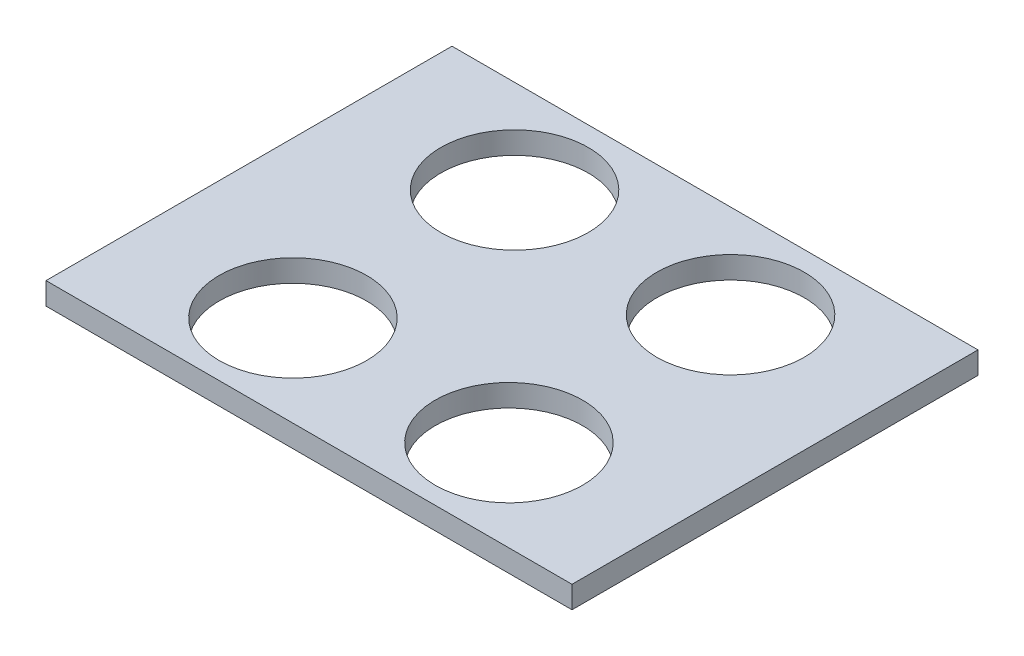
ISO-10303-21;
HEADER;
FILE_DESCRIPTION(('STEP AP214'),'2;1');
FILE_NAME('part.step','',(''),(''),'','','');
FILE_SCHEMA(('AUTOMOTIVE_DESIGN { 1 0 10303 214 1 1 1 1 }'));
ENDSEC;
DATA;
#1=APPLICATION_CONTEXT('core data for automotive mechanical design processes');
#2=APPLICATION_PROTOCOL_DEFINITION('international standard','automotive_design',2000,#1);
#3=PRODUCT_CONTEXT('',#1,'mechanical');
#4=PRODUCT('Part','Part','',(#3));
#5=PRODUCT_RELATED_PRODUCT_CATEGORY('part','',(#4));
#6=PRODUCT_DEFINITION_FORMATION('','',#4);
#7=PRODUCT_DEFINITION_CONTEXT('part definition',#1,'design');
#8=PRODUCT_DEFINITION('design','',#6,#7);
#9=PRODUCT_DEFINITION_SHAPE('','',#8);
#10=(LENGTH_UNIT() NAMED_UNIT(*) SI_UNIT(.MILLI.,.METRE.));
#11=(NAMED_UNIT(*) PLANE_ANGLE_UNIT() SI_UNIT($,.RADIAN.));
#12=(NAMED_UNIT(*) SI_UNIT($,.STERADIAN.) SOLID_ANGLE_UNIT());
#13=UNCERTAINTY_MEASURE_WITH_UNIT(LENGTH_MEASURE(1.E-05),#10,'distance_accuracy_value','');
#14=(GEOMETRIC_REPRESENTATION_CONTEXT(3) GLOBAL_UNCERTAINTY_ASSIGNED_CONTEXT((#13)) GLOBAL_UNIT_ASSIGNED_CONTEXT((#10,
#11,#12)) REPRESENTATION_CONTEXT('',''));
#15=CARTESIAN_POINT('',(0.,0.,0.));
#16=DIRECTION('',(0.,0.,1.));
#17=DIRECTION('',(1.,0.,0.));
#18=AXIS2_PLACEMENT_3D('',#15,#16,#17);
#19=CARTESIAN_POINT('',(-32.3739168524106,3.,28.235904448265));
#20=DIRECTION('',(1.,0.,0.));
#21=DIRECTION('',(0.,0.,-1.));
#22=AXIS2_PLACEMENT_3D('',#19,#20,#21);
#23=PLANE('',#22);
#24=DIRECTION('',(0.,0.,1.));
#25=VECTOR('',#24,1.);
#26=CARTESIAN_POINT('',(-32.3739168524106,0.,28.235904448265));
#27=LINE('',#26,#25);
#28=CARTESIAN_POINT('',(-32.3739168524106,0.,-26.8170664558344));
#29=VERTEX_POINT('',#28);
#30=CARTESIAN_POINT('',(-32.3739168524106,0.,28.235904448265));
#31=VERTEX_POINT('',#30);
#32=EDGE_CURVE('E98',#29,#31,#27,.T.);
#33=ORIENTED_EDGE('',*,*,#32,.T.);
#34=DIRECTION('',(0.,-1.,0.));
#35=VECTOR('',#34,1.);
#36=CARTESIAN_POINT('',(-32.3739168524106,3.,28.235904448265));
#37=LINE('',#36,#35);
#38=CARTESIAN_POINT('',(-32.3739168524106,3.,28.235904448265));
#39=VERTEX_POINT('',#38);
#40=EDGE_CURVE('E11',#39,#31,#37,.T.);
#41=ORIENTED_EDGE('',*,*,#40,.F.);
#42=DIRECTION('',(0.,0.,1.));
#43=VECTOR('',#42,1.);
#44=CARTESIAN_POINT('',(-32.3739168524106,3.,28.235904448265));
#45=LINE('',#44,#43);
#46=CARTESIAN_POINT('',(-32.3739168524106,3.,-26.8170664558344));
#47=VERTEX_POINT('',#46);
#48=EDGE_CURVE('E86',#47,#39,#45,.T.);
#49=ORIENTED_EDGE('',*,*,#48,.F.);
#50=DIRECTION('',(0.,-1.,0.));
#51=VECTOR('',#50,1.);
#52=CARTESIAN_POINT('',(-32.3739168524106,3.,-26.8170664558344));
#53=LINE('',#52,#51);
#54=EDGE_CURVE('E94',#47,#29,#53,.T.);
#55=ORIENTED_EDGE('',*,*,#54,.T.);
#56=EDGE_LOOP('',(#33,#41,#49,#55));
#57=FACE_BOUND('',#56,.T.);
#58=ADVANCED_FACE('F35',(#57),#23,.F.);
#59=CARTESIAN_POINT('',(38.9525737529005,3.,28.235904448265));
#60=DIRECTION('',(0.,0.,-1.));
#61=DIRECTION('',(-1.,0.,0.));
#62=AXIS2_PLACEMENT_3D('',#59,#60,#61);
#63=PLANE('',#62);
#64=DIRECTION('',(1.,0.,0.));
#65=VECTOR('',#64,1.);
#66=CARTESIAN_POINT('',(38.9525737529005,0.,28.235904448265));
#67=LINE('',#66,#65);
#68=CARTESIAN_POINT('',(38.9525737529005,0.,28.235904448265));
#69=VERTEX_POINT('',#68);
#70=EDGE_CURVE('E90',#31,#69,#67,.T.);
#71=ORIENTED_EDGE('',*,*,#70,.T.);
#72=DIRECTION('',(0.,-1.,0.));
#73=VECTOR('',#72,1.);
#74=CARTESIAN_POINT('',(38.9525737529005,3.,28.235904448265));
#75=LINE('',#74,#73);
#76=CARTESIAN_POINT('',(38.9525737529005,3.,28.235904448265));
#77=VERTEX_POINT('',#76);
#78=EDGE_CURVE('E43',#77,#69,#75,.T.);
#79=ORIENTED_EDGE('',*,*,#78,.F.);
#80=DIRECTION('',(1.,0.,0.));
#81=VECTOR('',#80,1.);
#82=CARTESIAN_POINT('',(38.9525737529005,3.,28.235904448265));
#83=LINE('',#82,#81);
#84=EDGE_CURVE('E81',#39,#77,#83,.T.);
#85=ORIENTED_EDGE('',*,*,#84,.F.);
#86=ORIENTED_EDGE('',*,*,#40,.T.);
#87=EDGE_LOOP('',(#71,#79,#85,#86));
#88=FACE_BOUND('',#87,.T.);
#89=ADVANCED_FACE('F89',(#88),#63,.F.);
#90=CARTESIAN_POINT('',(38.9525737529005,3.,-26.8170664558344));
#91=DIRECTION('',(-1.,0.,0.));
#92=DIRECTION('',(0.,0.,1.));
#93=AXIS2_PLACEMENT_3D('',#90,#91,#92);
#94=PLANE('',#93);
#95=DIRECTION('',(0.,0.,-1.));
#96=VECTOR('',#95,1.);
#97=CARTESIAN_POINT('',(38.9525737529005,0.,-26.8170664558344));
#98=LINE('',#97,#96);
#99=CARTESIAN_POINT('',(38.9525737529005,0.,-26.8170664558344));
#100=VERTEX_POINT('',#99);
#101=EDGE_CURVE('E68',#69,#100,#98,.T.);
#102=ORIENTED_EDGE('',*,*,#101,.T.);
#103=DIRECTION('',(0.,-1.,0.));
#104=VECTOR('',#103,1.);
#105=CARTESIAN_POINT('',(38.9525737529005,3.,-26.8170664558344));
#106=LINE('',#105,#104);
#107=CARTESIAN_POINT('',(38.9525737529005,3.,-26.8170664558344));
#108=VERTEX_POINT('',#107);
#109=EDGE_CURVE('E91',#108,#100,#106,.T.);
#110=ORIENTED_EDGE('',*,*,#109,.F.);
#111=DIRECTION('',(0.,0.,-1.));
#112=VECTOR('',#111,1.);
#113=CARTESIAN_POINT('',(38.9525737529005,3.,-26.8170664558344));
#114=LINE('',#113,#112);
#115=EDGE_CURVE('E84',#77,#108,#114,.T.);
#116=ORIENTED_EDGE('',*,*,#115,.F.);
#117=ORIENTED_EDGE('',*,*,#78,.T.);
#118=EDGE_LOOP('',(#102,#110,#116,#117));
#119=FACE_BOUND('',#118,.T.);
#120=ADVANCED_FACE('F92',(#119),#94,.F.);
#121=CARTESIAN_POINT('',(-32.3739168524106,3.,-26.8170664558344));
#122=DIRECTION('',(0.,0.,1.));
#123=DIRECTION('',(1.,0.,0.));
#124=AXIS2_PLACEMENT_3D('',#121,#122,#123);
#125=PLANE('',#124);
#126=DIRECTION('',(-1.,0.,0.));
#127=VECTOR('',#126,1.);
#128=CARTESIAN_POINT('',(-32.3739168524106,0.,-26.8170664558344));
#129=LINE('',#128,#127);
#130=EDGE_CURVE('E74',#100,#29,#129,.T.);
#131=ORIENTED_EDGE('',*,*,#130,.T.);
#132=ORIENTED_EDGE('',*,*,#54,.F.);
#133=DIRECTION('',(-1.,0.,0.));
#134=VECTOR('',#133,1.);
#135=CARTESIAN_POINT('',(-32.3739168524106,3.,-26.8170664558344));
#136=LINE('',#135,#134);
#137=EDGE_CURVE('E51',#108,#47,#136,.T.);
#138=ORIENTED_EDGE('',*,*,#137,.F.);
#139=ORIENTED_EDGE('',*,*,#109,.T.);
#140=EDGE_LOOP('',(#131,#132,#138,#139));
#141=FACE_BOUND('',#140,.T.);
#142=ADVANCED_FACE('F106',(#141),#125,.F.);
#143=CARTESIAN_POINT('',(0.,3.,0.));
#144=DIRECTION('',(0.,-1.,0.));
#145=DIRECTION('',(0.,0.,-1.));
#146=AXIS2_PLACEMENT_3D('',#143,#144,#145);
#147=PLANE('',#146);
#148=CARTESIAN_POINT('',(-11.2436796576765,3.,15.8842099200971));
#149=DIRECTION('',(0.,1.,0.));
#150=DIRECTION('',(0.,0.,1.));
#151=AXIS2_PLACEMENT_3D('',#148,#149,#150);
#152=CIRCLE('',#151,10.);
#153=CARTESIAN_POINT('',(-11.2436796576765,3.,25.8842099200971));
#154=VERTEX_POINT('',#153);
#155=EDGE_CURVE('E118',#154,#154,#152,.T.);
#156=ORIENTED_EDGE('',*,*,#155,.F.);
#157=EDGE_LOOP('',(#156));
#158=FACE_BOUND('',#157,.T.);
#159=CARTESIAN_POINT('',(18.0454592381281,3.,15.8842099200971));
#160=DIRECTION('',(0.,1.,0.));
#161=DIRECTION('',(0.,0.,1.));
#162=AXIS2_PLACEMENT_3D('',#159,#160,#161);
#163=CIRCLE('',#162,10.);
#164=CARTESIAN_POINT('',(18.0454592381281,3.,25.8842099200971));
#165=VERTEX_POINT('',#164);
#166=EDGE_CURVE('E124',#165,#165,#163,.T.);
#167=ORIENTED_EDGE('',*,*,#166,.F.);
#168=EDGE_LOOP('',(#167));
#169=FACE_BOUND('',#168,.T.);
#170=CARTESIAN_POINT('',(18.0454592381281,3.,-14.1689934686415));
#171=DIRECTION('',(0.,1.,0.));
#172=DIRECTION('',(0.,0.,1.));
#173=AXIS2_PLACEMENT_3D('',#170,#171,#172);
#174=CIRCLE('',#173,10.);
#175=CARTESIAN_POINT('',(18.0454592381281,3.,-4.16899346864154));
#176=VERTEX_POINT('',#175);
#177=EDGE_CURVE('E130',#176,#176,#174,.T.);
#178=ORIENTED_EDGE('',*,*,#177,.F.);
#179=EDGE_LOOP('',(#178));
#180=FACE_BOUND('',#179,.T.);
#181=CARTESIAN_POINT('',(-11.2436796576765,3.,-14.1689934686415));
#182=DIRECTION('',(0.,1.,0.));
#183=DIRECTION('',(0.,0.,1.));
#184=AXIS2_PLACEMENT_3D('',#181,#182,#183);
#185=CIRCLE('',#184,10.);
#186=CARTESIAN_POINT('',(-11.2436796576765,3.,-4.16899346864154));
#187=VERTEX_POINT('',#186);
#188=EDGE_CURVE('E112',#187,#187,#185,.T.);
#189=ORIENTED_EDGE('',*,*,#188,.F.);
#190=EDGE_LOOP('',(#189));
#191=FACE_BOUND('',#190,.T.);
#192=ORIENTED_EDGE('',*,*,#48,.T.);
#193=ORIENTED_EDGE('',*,*,#84,.T.);
#194=ORIENTED_EDGE('',*,*,#115,.T.);
#195=ORIENTED_EDGE('',*,*,#137,.T.);
#196=EDGE_LOOP('',(#192,#193,#194,#195));
#197=FACE_BOUND('',#196,.T.);
#198=ADVANCED_FACE('F82',(#158,#169,#180,#191,#197),#147,.F.);
#199=CARTESIAN_POINT('',(0.,0.,0.));
#200=DIRECTION('',(0.,-1.,0.));
#201=DIRECTION('',(0.,0.,-1.));
#202=AXIS2_PLACEMENT_3D('',#199,#200,#201);
#203=PLANE('',#202);
#204=CARTESIAN_POINT('',(-11.2436796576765,0.,15.8842099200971));
#205=DIRECTION('',(0.,1.,0.));
#206=DIRECTION('',(0.,0.,1.));
#207=AXIS2_PLACEMENT_3D('',#204,#205,#206);
#208=CIRCLE('',#207,10.);
#209=CARTESIAN_POINT('',(-11.2436796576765,0.,25.8842099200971));
#210=VERTEX_POINT('',#209);
#211=EDGE_CURVE('E121',#210,#210,#208,.T.);
#212=ORIENTED_EDGE('',*,*,#211,.T.);
#213=EDGE_LOOP('',(#212));
#214=FACE_BOUND('',#213,.T.);
#215=CARTESIAN_POINT('',(18.0454592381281,0.,15.8842099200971));
#216=DIRECTION('',(0.,1.,0.));
#217=DIRECTION('',(0.,0.,1.));
#218=AXIS2_PLACEMENT_3D('',#215,#216,#217);
#219=CIRCLE('',#218,10.);
#220=CARTESIAN_POINT('',(18.0454592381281,0.,25.8842099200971));
#221=VERTEX_POINT('',#220);
#222=EDGE_CURVE('E127',#221,#221,#219,.T.);
#223=ORIENTED_EDGE('',*,*,#222,.T.);
#224=EDGE_LOOP('',(#223));
#225=FACE_BOUND('',#224,.T.);
#226=CARTESIAN_POINT('',(18.0454592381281,0.,-14.1689934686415));
#227=DIRECTION('',(0.,1.,0.));
#228=DIRECTION('',(0.,0.,1.));
#229=AXIS2_PLACEMENT_3D('',#226,#227,#228);
#230=CIRCLE('',#229,10.);
#231=CARTESIAN_POINT('',(18.0454592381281,0.,-4.16899346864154));
#232=VERTEX_POINT('',#231);
#233=EDGE_CURVE('E115',#232,#232,#230,.T.);
#234=ORIENTED_EDGE('',*,*,#233,.T.);
#235=EDGE_LOOP('',(#234));
#236=FACE_BOUND('',#235,.T.);
#237=CARTESIAN_POINT('',(-11.2436796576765,0.,-14.1689934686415));
#238=DIRECTION('',(0.,1.,0.));
#239=DIRECTION('',(0.,0.,1.));
#240=AXIS2_PLACEMENT_3D('',#237,#238,#239);
#241=CIRCLE('',#240,10.);
#242=CARTESIAN_POINT('',(-11.2436796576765,0.,-4.16899346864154));
#243=VERTEX_POINT('',#242);
#244=EDGE_CURVE('E101',#243,#243,#241,.T.);
#245=ORIENTED_EDGE('',*,*,#244,.T.);
#246=EDGE_LOOP('',(#245));
#247=FACE_BOUND('',#246,.T.);
#248=ORIENTED_EDGE('',*,*,#32,.F.);
#249=ORIENTED_EDGE('',*,*,#130,.F.);
#250=ORIENTED_EDGE('',*,*,#101,.F.);
#251=ORIENTED_EDGE('',*,*,#70,.F.);
#252=EDGE_LOOP('',(#248,#249,#250,#251));
#253=FACE_BOUND('',#252,.T.);
#254=ADVANCED_FACE('F109',(#214,#225,#236,#247,#253),#203,.T.);
#255=CARTESIAN_POINT('',(-11.2436796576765,0.,-14.1689934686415));
#256=DIRECTION('',(0.,1.,0.));
#257=DIRECTION('',(0.,0.,1.));
#258=AXIS2_PLACEMENT_3D('',#255,#256,#257);
#259=CYLINDRICAL_SURFACE('',#258,10.);
#260=ORIENTED_EDGE('',*,*,#244,.F.);
#261=EDGE_LOOP('',(#260));
#262=FACE_BOUND('',#261,.T.);
#263=ORIENTED_EDGE('',*,*,#188,.T.);
#264=EDGE_LOOP('',(#263));
#265=FACE_BOUND('',#264,.T.);
#266=ADVANCED_FACE('F142',(#262,#265),#259,.F.);
#267=CARTESIAN_POINT('',(18.0454592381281,0.,-14.1689934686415));
#268=DIRECTION('',(0.,1.,0.));
#269=DIRECTION('',(0.,0.,1.));
#270=AXIS2_PLACEMENT_3D('',#267,#268,#269);
#271=CYLINDRICAL_SURFACE('',#270,10.);
#272=ORIENTED_EDGE('',*,*,#233,.F.);
#273=EDGE_LOOP('',(#272));
#274=FACE_BOUND('',#273,.T.);
#275=ORIENTED_EDGE('',*,*,#177,.T.);
#276=EDGE_LOOP('',(#275));
#277=FACE_BOUND('',#276,.T.);
#278=ADVANCED_FACE('F138',(#274,#277),#271,.F.);
#279=CARTESIAN_POINT('',(18.0454592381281,0.,15.8842099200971));
#280=DIRECTION('',(0.,1.,0.));
#281=DIRECTION('',(0.,0.,1.));
#282=AXIS2_PLACEMENT_3D('',#279,#280,#281);
#283=CYLINDRICAL_SURFACE('',#282,10.);
#284=ORIENTED_EDGE('',*,*,#222,.F.);
#285=EDGE_LOOP('',(#284));
#286=FACE_BOUND('',#285,.T.);
#287=ORIENTED_EDGE('',*,*,#166,.T.);
#288=EDGE_LOOP('',(#287));
#289=FACE_BOUND('',#288,.T.);
#290=ADVANCED_FACE('F141',(#286,#289),#283,.F.);
#291=CARTESIAN_POINT('',(-11.2436796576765,0.,15.8842099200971));
#292=DIRECTION('',(0.,1.,0.));
#293=DIRECTION('',(0.,0.,1.));
#294=AXIS2_PLACEMENT_3D('',#291,#292,#293);
#295=CYLINDRICAL_SURFACE('',#294,10.);
#296=ORIENTED_EDGE('',*,*,#211,.F.);
#297=EDGE_LOOP('',(#296));
#298=FACE_BOUND('',#297,.T.);
#299=ORIENTED_EDGE('',*,*,#155,.T.);
#300=EDGE_LOOP('',(#299));
#301=FACE_BOUND('',#300,.T.);
#302=ADVANCED_FACE('F203',(#298,#301),#295,.F.);
#303=CLOSED_SHELL('',(#58,#89,#120,#142,#198,#254,#266,#278,#290,#302));
#304=MANIFOLD_SOLID_BREP('B2',#303);
#305=ADVANCED_BREP_SHAPE_REPRESENTATION('',(#18,#304),#14);
#306=SHAPE_DEFINITION_REPRESENTATION(#9,#305);
ENDSEC;
END-ISO-10303-21;
